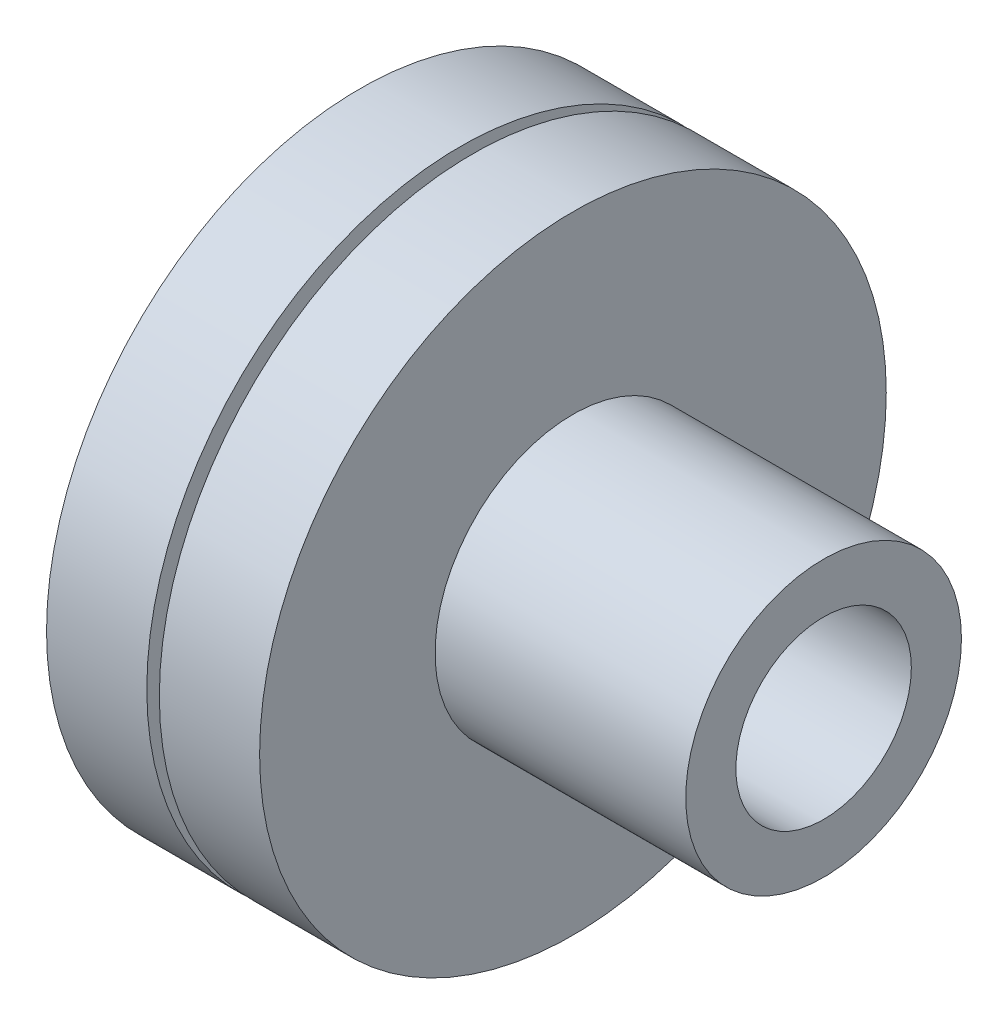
from build123d import *


with BuildPart() as part:
    # Sketch1 → Revolve1 (revolve)
    with BuildSketch(Plane.XY, mode=Mode.PRIVATE) as revolve1_sk:
        Polygon((80, 125), (40, 125), (40, 55), (0, 55), (0, 35), (80, 35), align=None)
        Polygon((85, 35), (85, 125), (125, 125), (125, 55), (225, 55), (225, 35), align=None)
    revolve(revolve1_sk.sketch.rotate(Axis((0, 0, 0), (-1, 0, 0)), 90), axis=Axis((0, 0, 0), (-1, 0, 0)))


solid = part.part
